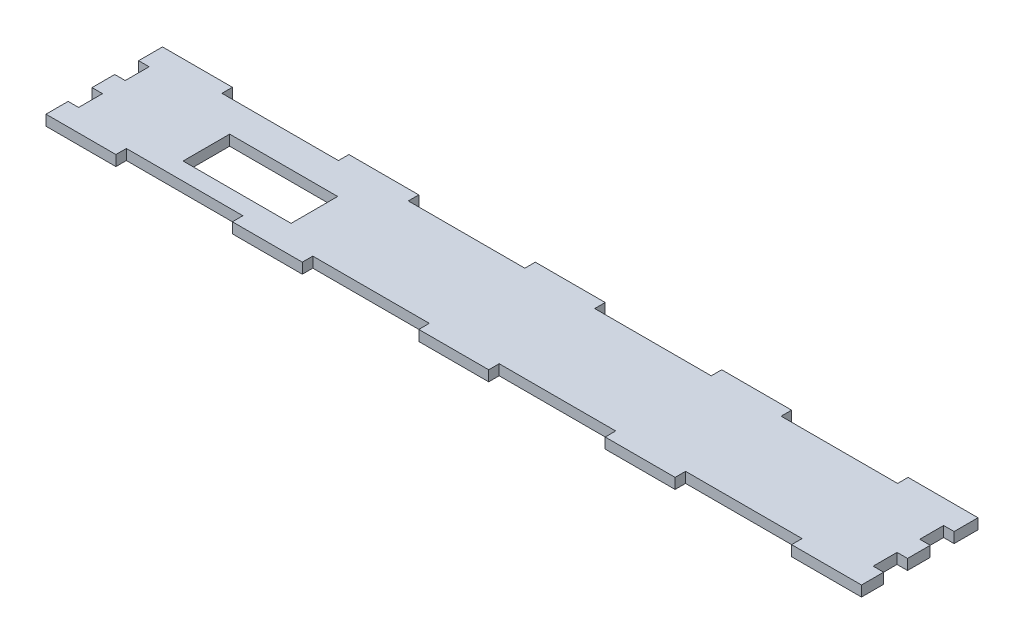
from build123d import *

# Parameters (mm, degrees)
BOSS_EXTRUDE1_DEPTH = 9
SKETCH2_W           = 100
SKETCH2_H           = 9
CUT_EXTRUDE1_DEPTH  = 9
SKETCH5_W           = 92.7
SKETCH5_H           = 40
CUT_EXTRUDE2_DEPTH  = 354.667923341


with BuildPart() as part:
    # Sketch1 → Boss-Extrude1 (new body)
    with BuildSketch(Plane(origin=(0, 0, 0), x_dir=(1, 0, 0), z_dir=(0, 1, 0))):
        Polygon((-350, 50), (350, 50), (350, 29.5), (341, 29.5), (341, 9), (350, 9), (350, -10.5), (341, -10.5), (341, -31), (350, -31), (350, -50), (-350, -50), (-350, -31), (-341, -31), (-341, -10.5), (-350, -10.5), (-350, 9), (-341, 9), (-341, 29.5), (-350, 29.5), align=None)
    extrude(amount=BOSS_EXTRUDE1_DEPTH)

    # Sketch2 → Cut-Extrude1 (cut)
    with BuildSketch(Plane(origin=(0, 9, 0), x_dir=(1, 0, 0), z_dir=(0, 1, 0))):
        with Locations((-240, 45.5)):
            Rectangle(SKETCH2_W, SKETCH2_H)
        with Locations((-80, 45.5)):
            Rectangle(SKETCH2_W, SKETCH2_H)
        with Locations((80, 45.5)):
            Rectangle(SKETCH2_W, SKETCH2_H)
        with Locations((240, 45.5)):
            Rectangle(SKETCH2_W, SKETCH2_H)
        with Locations((240, -45.5)):
            Rectangle(SKETCH2_W, SKETCH2_H)
        with Locations((80, -45.5)):
            Rectangle(SKETCH2_W, SKETCH2_H)
        with Locations((-80, -45.5)):
            Rectangle(SKETCH2_W, SKETCH2_H)
        with Locations((-240, -45.5)):
            Rectangle(SKETCH2_W, SKETCH2_H)
    extrude(amount=-CUT_EXTRUDE1_DEPTH, mode=Mode.SUBTRACT)

    # Sketch5 → Cut-Extrude2 (cut, through all)
    with BuildSketch(Plane(origin=(0, 9, 0), x_dir=(1, 0, 0), z_dir=(0, 1, 0))):
        with Locations((-209.994536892, -6)):
            Rectangle(SKETCH5_W, SKETCH5_H)
    extrude(amount=-CUT_EXTRUDE2_DEPTH, mode=Mode.SUBTRACT)


solid = part.part
